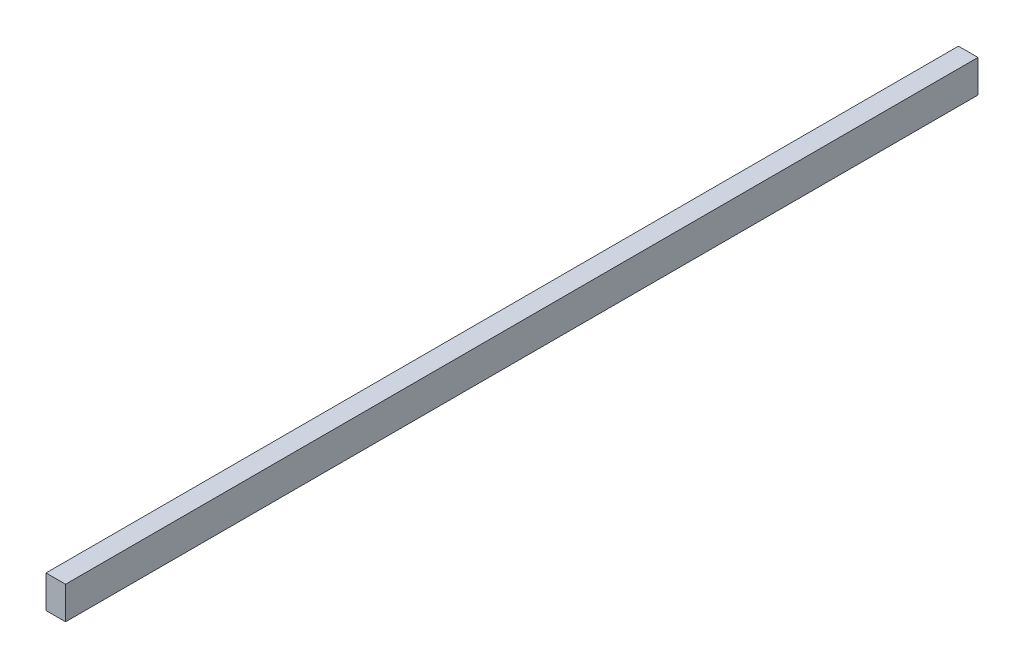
from build123d import *

# Parameters (mm, degrees)
ESQUISSE1_W      = 18
ESQUISSE1_H      = 30
EXTRUSION1_DEPTH = 840


with BuildPart() as part:
    # Esquisse1 → Extrusion1 (new body)
    with BuildSketch(Plane.XY):
        with Locations((9, 15)):
            Rectangle(ESQUISSE1_W, ESQUISSE1_H)
    extrude(amount=EXTRUSION1_DEPTH)


solid = part.part
